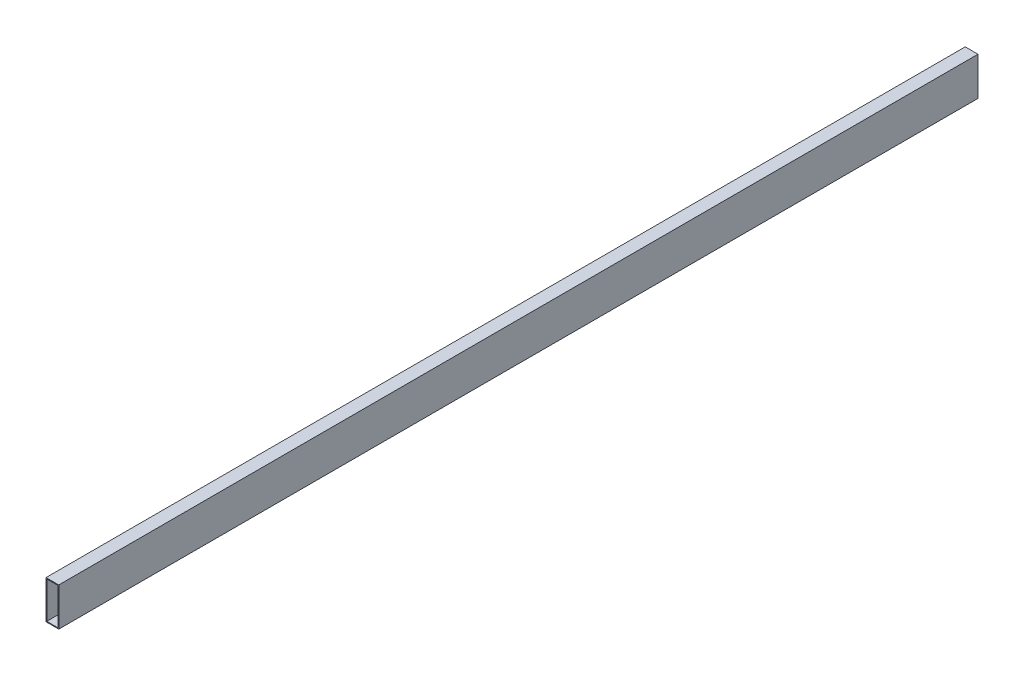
ISO-10303-21;
HEADER;
FILE_DESCRIPTION(('STEP AP214'),'2;1');
FILE_NAME('part.step','',(''),(''),'','','');
FILE_SCHEMA(('AUTOMOTIVE_DESIGN { 1 0 10303 214 1 1 1 1 }'));
ENDSEC;
DATA;
#1=APPLICATION_CONTEXT('core data for automotive mechanical design processes');
#2=APPLICATION_PROTOCOL_DEFINITION('international standard','automotive_design',2000,#1);
#3=PRODUCT_CONTEXT('',#1,'mechanical');
#4=PRODUCT('Part','Part','',(#3));
#5=PRODUCT_RELATED_PRODUCT_CATEGORY('part','',(#4));
#6=PRODUCT_DEFINITION_FORMATION('','',#4);
#7=PRODUCT_DEFINITION_CONTEXT('part definition',#1,'design');
#8=PRODUCT_DEFINITION('design','',#6,#7);
#9=PRODUCT_DEFINITION_SHAPE('','',#8);
#10=(LENGTH_UNIT() NAMED_UNIT(*) SI_UNIT(.MILLI.,.METRE.));
#11=(NAMED_UNIT(*) PLANE_ANGLE_UNIT() SI_UNIT($,.RADIAN.));
#12=(NAMED_UNIT(*) SI_UNIT($,.STERADIAN.) SOLID_ANGLE_UNIT());
#13=UNCERTAINTY_MEASURE_WITH_UNIT(LENGTH_MEASURE(1.E-05),#10,'distance_accuracy_value','');
#14=(GEOMETRIC_REPRESENTATION_CONTEXT(3) GLOBAL_UNCERTAINTY_ASSIGNED_CONTEXT((#13)) GLOBAL_UNIT_ASSIGNED_CONTEXT((#10,
#11,#12)) REPRESENTATION_CONTEXT('',''));
#15=CARTESIAN_POINT('',(0.,0.,0.));
#16=DIRECTION('',(0.,0.,1.));
#17=DIRECTION('',(1.,0.,0.));
#18=AXIS2_PLACEMENT_3D('',#15,#16,#17);
#19=CARTESIAN_POINT('',(0.,152.4,3657.6));
#20=DIRECTION('',(0.,0.,-1.));
#21=DIRECTION('',(-1.,0.,0.));
#22=AXIS2_PLACEMENT_3D('',#19,#20,#21);
#23=PLANE('',#22);
#24=DIRECTION('',(0.,-1.,0.));
#25=VECTOR('',#24,1.);
#26=CARTESIAN_POINT('',(0.,0.,3657.6));
#27=LINE('',#26,#25);
#28=CARTESIAN_POINT('',(0.,152.4,3657.6));
#29=VERTEX_POINT('',#28);
#30=CARTESIAN_POINT('',(0.,0.,3657.6));
#31=VERTEX_POINT('',#30);
#32=EDGE_CURVE('E114',#29,#31,#27,.T.);
#33=ORIENTED_EDGE('',*,*,#32,.T.);
#34=DIRECTION('',(1.,0.,0.));
#35=VECTOR('',#34,1.);
#36=CARTESIAN_POINT('',(0.,0.,3657.6));
#37=LINE('',#36,#35);
#38=CARTESIAN_POINT('',(50.8,0.,3657.6));
#39=VERTEX_POINT('',#38);
#40=EDGE_CURVE('E117',#31,#39,#37,.T.);
#41=ORIENTED_EDGE('',*,*,#40,.T.);
#42=DIRECTION('',(0.,1.,0.));
#43=VECTOR('',#42,1.);
#44=CARTESIAN_POINT('',(50.8,0.,3657.6));
#45=LINE('',#44,#43);
#46=CARTESIAN_POINT('',(50.8,152.4,3657.6));
#47=VERTEX_POINT('',#46);
#48=EDGE_CURVE('E120',#39,#47,#45,.T.);
#49=ORIENTED_EDGE('',*,*,#48,.T.);
#50=DIRECTION('',(-1.,0.,0.));
#51=VECTOR('',#50,1.);
#52=CARTESIAN_POINT('',(0.,152.4,3657.6));
#53=LINE('',#52,#51);
#54=EDGE_CURVE('E122',#47,#29,#53,.T.);
#55=ORIENTED_EDGE('',*,*,#54,.T.);
#56=EDGE_LOOP('',(#33,#41,#49,#55));
#57=FACE_BOUND('',#56,.T.);
#58=DIRECTION('',(0.,-1.,0.));
#59=VECTOR('',#58,1.);
#60=CARTESIAN_POINT('',(3.17499999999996,152.4,3657.6));
#61=LINE('',#60,#59);
#62=CARTESIAN_POINT('',(3.17499999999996,149.225,3657.6));
#63=VERTEX_POINT('',#62);
#64=CARTESIAN_POINT('',(3.175,3.175,3657.6));
#65=VERTEX_POINT('',#64);
#66=EDGE_CURVE('E102',#63,#65,#61,.T.);
#67=ORIENTED_EDGE('',*,*,#66,.F.);
#68=DIRECTION('',(-1.,0.,0.));
#69=VECTOR('',#68,1.);
#70=CARTESIAN_POINT('',(0.,149.225,3657.6));
#71=LINE('',#70,#69);
#72=CARTESIAN_POINT('',(47.625,149.225,3657.6));
#73=VERTEX_POINT('',#72);
#74=EDGE_CURVE('E87',#73,#63,#71,.T.);
#75=ORIENTED_EDGE('',*,*,#74,.F.);
#76=DIRECTION('',(0.,1.,0.));
#77=VECTOR('',#76,1.);
#78=CARTESIAN_POINT('',(47.625,152.4,3657.6));
#79=LINE('',#78,#77);
#80=CARTESIAN_POINT('',(47.625,3.175,3657.6));
#81=VERTEX_POINT('',#80);
#82=EDGE_CURVE('E111',#81,#73,#79,.T.);
#83=ORIENTED_EDGE('',*,*,#82,.F.);
#84=DIRECTION('',(1.,0.,0.));
#85=VECTOR('',#84,1.);
#86=CARTESIAN_POINT('',(0.,3.175,3657.6));
#87=LINE('',#86,#85);
#88=EDGE_CURVE('E104',#65,#81,#87,.T.);
#89=ORIENTED_EDGE('',*,*,#88,.F.);
#90=EDGE_LOOP('',(#67,#75,#83,#89));
#91=FACE_BOUND('',#90,.T.);
#92=ADVANCED_FACE('F17',(#57,#91),#23,.F.);
#93=CARTESIAN_POINT('',(0.,152.4,0.));
#94=DIRECTION('',(0.,0.,-1.));
#95=DIRECTION('',(-1.,0.,0.));
#96=AXIS2_PLACEMENT_3D('',#93,#94,#95);
#97=PLANE('',#96);
#98=DIRECTION('',(0.,-1.,0.));
#99=VECTOR('',#98,1.);
#100=CARTESIAN_POINT('',(0.,0.,0.));
#101=LINE('',#100,#99);
#102=CARTESIAN_POINT('',(0.,152.4,0.));
#103=VERTEX_POINT('',#102);
#104=CARTESIAN_POINT('',(0.,0.,0.));
#105=VERTEX_POINT('',#104);
#106=EDGE_CURVE('E125',#103,#105,#101,.T.);
#107=ORIENTED_EDGE('',*,*,#106,.F.);
#108=DIRECTION('',(-1.,0.,0.));
#109=VECTOR('',#108,1.);
#110=CARTESIAN_POINT('',(0.,152.4,0.));
#111=LINE('',#110,#109);
#112=CARTESIAN_POINT('',(50.8,152.4,0.));
#113=VERTEX_POINT('',#112);
#114=EDGE_CURVE('E118',#113,#103,#111,.T.);
#115=ORIENTED_EDGE('',*,*,#114,.F.);
#116=DIRECTION('',(0.,1.,0.));
#117=VECTOR('',#116,1.);
#118=CARTESIAN_POINT('',(50.8,0.,0.));
#119=LINE('',#118,#117);
#120=CARTESIAN_POINT('',(50.8,0.,0.));
#121=VERTEX_POINT('',#120);
#122=EDGE_CURVE('E130',#121,#113,#119,.T.);
#123=ORIENTED_EDGE('',*,*,#122,.F.);
#124=DIRECTION('',(1.,0.,0.));
#125=VECTOR('',#124,1.);
#126=CARTESIAN_POINT('',(0.,0.,0.));
#127=LINE('',#126,#125);
#128=EDGE_CURVE('E128',#105,#121,#127,.T.);
#129=ORIENTED_EDGE('',*,*,#128,.F.);
#130=EDGE_LOOP('',(#107,#115,#123,#129));
#131=FACE_BOUND('',#130,.T.);
#132=DIRECTION('',(-1.,0.,0.));
#133=VECTOR('',#132,1.);
#134=CARTESIAN_POINT('',(0.,149.225,0.));
#135=LINE('',#134,#133);
#136=CARTESIAN_POINT('',(47.625,149.225,0.));
#137=VERTEX_POINT('',#136);
#138=CARTESIAN_POINT('',(3.17499999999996,149.225,0.));
#139=VERTEX_POINT('',#138);
#140=EDGE_CURVE('E85',#137,#139,#135,.T.);
#141=ORIENTED_EDGE('',*,*,#140,.T.);
#142=DIRECTION('',(0.,-1.,0.));
#143=VECTOR('',#142,1.);
#144=CARTESIAN_POINT('',(3.17499999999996,152.4,0.));
#145=LINE('',#144,#143);
#146=CARTESIAN_POINT('',(3.175,3.175,0.));
#147=VERTEX_POINT('',#146);
#148=EDGE_CURVE('E93',#139,#147,#145,.T.);
#149=ORIENTED_EDGE('',*,*,#148,.T.);
#150=DIRECTION('',(1.,0.,0.));
#151=VECTOR('',#150,1.);
#152=CARTESIAN_POINT('',(0.,3.175,0.));
#153=LINE('',#152,#151);
#154=CARTESIAN_POINT('',(47.625,3.175,0.));
#155=VERTEX_POINT('',#154);
#156=EDGE_CURVE('E99',#147,#155,#153,.T.);
#157=ORIENTED_EDGE('',*,*,#156,.T.);
#158=DIRECTION('',(0.,1.,0.));
#159=VECTOR('',#158,1.);
#160=CARTESIAN_POINT('',(47.625,152.4,0.));
#161=LINE('',#160,#159);
#162=EDGE_CURVE('E39',#155,#137,#161,.T.);
#163=ORIENTED_EDGE('',*,*,#162,.T.);
#164=EDGE_LOOP('',(#141,#149,#157,#163));
#165=FACE_BOUND('',#164,.T.);
#166=ADVANCED_FACE('F101',(#131,#165),#97,.T.);
#167=CARTESIAN_POINT('',(0.,0.,3657.6));
#168=DIRECTION('',(1.,0.,0.));
#169=DIRECTION('',(0.,1.,0.));
#170=AXIS2_PLACEMENT_3D('',#167,#168,#169);
#171=PLANE('',#170);
#172=ORIENTED_EDGE('',*,*,#106,.T.);
#173=DIRECTION('',(0.,0.,-1.));
#174=VECTOR('',#173,1.);
#175=CARTESIAN_POINT('',(0.,0.,3657.6));
#176=LINE('',#175,#174);
#177=EDGE_CURVE('E11',#31,#105,#176,.T.);
#178=ORIENTED_EDGE('',*,*,#177,.F.);
#179=ORIENTED_EDGE('',*,*,#32,.F.);
#180=DIRECTION('',(0.,0.,-1.));
#181=VECTOR('',#180,1.);
#182=CARTESIAN_POINT('',(0.,152.4,3657.6));
#183=LINE('',#182,#181);
#184=EDGE_CURVE('E124',#29,#103,#183,.T.);
#185=ORIENTED_EDGE('',*,*,#184,.T.);
#186=EDGE_LOOP('',(#172,#178,#179,#185));
#187=FACE_BOUND('',#186,.T.);
#188=ADVANCED_FACE('F19',(#187),#171,.F.);
#189=CARTESIAN_POINT('',(0.,0.,3657.6));
#190=DIRECTION('',(0.,1.,0.));
#191=DIRECTION('',(0.,0.,1.));
#192=AXIS2_PLACEMENT_3D('',#189,#190,#191);
#193=PLANE('',#192);
#194=ORIENTED_EDGE('',*,*,#128,.T.);
#195=DIRECTION('',(0.,0.,-1.));
#196=VECTOR('',#195,1.);
#197=CARTESIAN_POINT('',(50.8,0.,3657.6));
#198=LINE('',#197,#196);
#199=EDGE_CURVE('E25',#39,#121,#198,.T.);
#200=ORIENTED_EDGE('',*,*,#199,.F.);
#201=ORIENTED_EDGE('',*,*,#40,.F.);
#202=ORIENTED_EDGE('',*,*,#177,.T.);
#203=EDGE_LOOP('',(#194,#200,#201,#202));
#204=FACE_BOUND('',#203,.T.);
#205=ADVANCED_FACE('F157',(#204),#193,.F.);
#206=CARTESIAN_POINT('',(50.8,0.,3657.6));
#207=DIRECTION('',(-1.,0.,0.));
#208=DIRECTION('',(0.,0.,1.));
#209=AXIS2_PLACEMENT_3D('',#206,#207,#208);
#210=PLANE('',#209);
#211=ORIENTED_EDGE('',*,*,#122,.T.);
#212=DIRECTION('',(0.,0.,-1.));
#213=VECTOR('',#212,1.);
#214=CARTESIAN_POINT('',(50.8,152.4,3657.6));
#215=LINE('',#214,#213);
#216=EDGE_CURVE('E135',#47,#113,#215,.T.);
#217=ORIENTED_EDGE('',*,*,#216,.F.);
#218=ORIENTED_EDGE('',*,*,#48,.F.);
#219=ORIENTED_EDGE('',*,*,#199,.T.);
#220=EDGE_LOOP('',(#211,#217,#218,#219));
#221=FACE_BOUND('',#220,.T.);
#222=ADVANCED_FACE('F142',(#221),#210,.F.);
#223=CARTESIAN_POINT('',(0.,152.4,3657.6));
#224=DIRECTION('',(0.,-1.,0.));
#225=DIRECTION('',(0.,0.,-1.));
#226=AXIS2_PLACEMENT_3D('',#223,#224,#225);
#227=PLANE('',#226);
#228=ORIENTED_EDGE('',*,*,#114,.T.);
#229=ORIENTED_EDGE('',*,*,#184,.F.);
#230=ORIENTED_EDGE('',*,*,#54,.F.);
#231=ORIENTED_EDGE('',*,*,#216,.T.);
#232=EDGE_LOOP('',(#228,#229,#230,#231));
#233=FACE_BOUND('',#232,.T.);
#234=ADVANCED_FACE('F150',(#233),#227,.F.);
#235=CARTESIAN_POINT('',(3.175,0.,3657.6));
#236=DIRECTION('',(1.,0.,0.));
#237=DIRECTION('',(0.,1.,0.));
#238=AXIS2_PLACEMENT_3D('',#235,#236,#237);
#239=PLANE('',#238);
#240=ORIENTED_EDGE('',*,*,#148,.F.);
#241=DIRECTION('',(0.,0.,-1.));
#242=VECTOR('',#241,1.);
#243=CARTESIAN_POINT('',(3.17499999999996,149.225,3657.6));
#244=LINE('',#243,#242);
#245=EDGE_CURVE('E81',#63,#139,#244,.T.);
#246=ORIENTED_EDGE('',*,*,#245,.F.);
#247=ORIENTED_EDGE('',*,*,#66,.T.);
#248=DIRECTION('',(0.,0.,-1.));
#249=VECTOR('',#248,1.);
#250=CARTESIAN_POINT('',(3.175,3.175,3657.6));
#251=LINE('',#250,#249);
#252=EDGE_CURVE('E96',#65,#147,#251,.T.);
#253=ORIENTED_EDGE('',*,*,#252,.T.);
#254=EDGE_LOOP('',(#240,#246,#247,#253));
#255=FACE_BOUND('',#254,.T.);
#256=ADVANCED_FACE('F94',(#255),#239,.T.);
#257=CARTESIAN_POINT('',(0.,3.175,3657.6));
#258=DIRECTION('',(0.,1.,0.));
#259=DIRECTION('',(0.,0.,1.));
#260=AXIS2_PLACEMENT_3D('',#257,#258,#259);
#261=PLANE('',#260);
#262=ORIENTED_EDGE('',*,*,#156,.F.);
#263=ORIENTED_EDGE('',*,*,#252,.F.);
#264=ORIENTED_EDGE('',*,*,#88,.T.);
#265=DIRECTION('',(0.,0.,-1.));
#266=VECTOR('',#265,1.);
#267=CARTESIAN_POINT('',(47.625,3.175,3657.6));
#268=LINE('',#267,#266);
#269=EDGE_CURVE('E248',#81,#155,#268,.T.);
#270=ORIENTED_EDGE('',*,*,#269,.T.);
#271=EDGE_LOOP('',(#262,#263,#264,#270));
#272=FACE_BOUND('',#271,.T.);
#273=ADVANCED_FACE('F181',(#272),#261,.T.);
#274=CARTESIAN_POINT('',(47.625,0.,3657.6));
#275=DIRECTION('',(-1.,0.,0.));
#276=DIRECTION('',(0.,0.,1.));
#277=AXIS2_PLACEMENT_3D('',#274,#275,#276);
#278=PLANE('',#277);
#279=ORIENTED_EDGE('',*,*,#162,.F.);
#280=ORIENTED_EDGE('',*,*,#269,.F.);
#281=ORIENTED_EDGE('',*,*,#82,.T.);
#282=DIRECTION('',(0.,0.,-1.));
#283=VECTOR('',#282,1.);
#284=CARTESIAN_POINT('',(47.625,149.225,3657.6));
#285=LINE('',#284,#283);
#286=EDGE_CURVE('E32',#73,#137,#285,.T.);
#287=ORIENTED_EDGE('',*,*,#286,.T.);
#288=EDGE_LOOP('',(#279,#280,#281,#287));
#289=FACE_BOUND('',#288,.T.);
#290=ADVANCED_FACE('F187',(#289),#278,.T.);
#291=CARTESIAN_POINT('',(0.,149.225,3657.6));
#292=DIRECTION('',(0.,-1.,0.));
#293=DIRECTION('',(0.,0.,-1.));
#294=AXIS2_PLACEMENT_3D('',#291,#292,#293);
#295=PLANE('',#294);
#296=ORIENTED_EDGE('',*,*,#140,.F.);
#297=ORIENTED_EDGE('',*,*,#286,.F.);
#298=ORIENTED_EDGE('',*,*,#74,.T.);
#299=ORIENTED_EDGE('',*,*,#245,.T.);
#300=EDGE_LOOP('',(#296,#297,#298,#299));
#301=FACE_BOUND('',#300,.T.);
#302=ADVANCED_FACE('F83',(#301),#295,.T.);
#303=CLOSED_SHELL('',(#92,#166,#188,#205,#222,#234,#256,#273,#290,#302));
#304=MANIFOLD_SOLID_BREP('B1',#303);
#305=ADVANCED_BREP_SHAPE_REPRESENTATION('',(#18,#304),#14);
#306=SHAPE_DEFINITION_REPRESENTATION(#9,#305);
ENDSEC;
END-ISO-10303-21;
